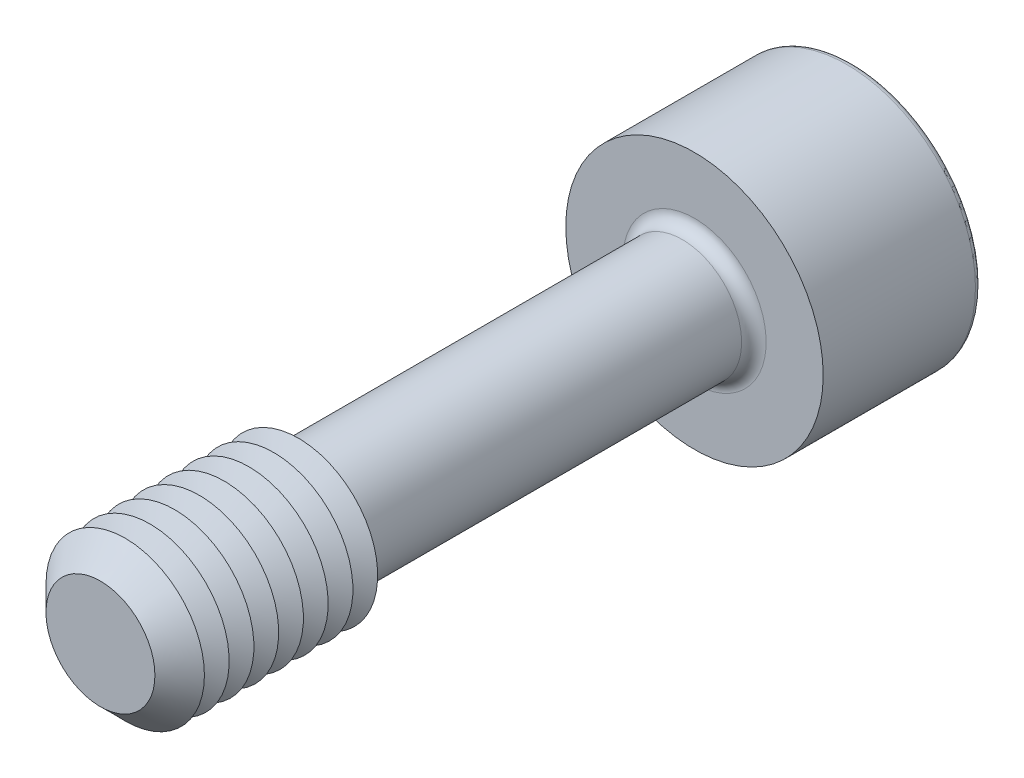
ISO-10303-21;
HEADER;
FILE_DESCRIPTION(('STEP AP214'),'2;1');
FILE_NAME('part.step','',(''),(''),'','','');
FILE_SCHEMA(('AUTOMOTIVE_DESIGN { 1 0 10303 214 1 1 1 1 }'));
ENDSEC;
DATA;
#1=APPLICATION_CONTEXT('core data for automotive mechanical design processes');
#2=APPLICATION_PROTOCOL_DEFINITION('international standard','automotive_design',2000,#1);
#3=PRODUCT_CONTEXT('',#1,'mechanical');
#4=PRODUCT('Part','Part','',(#3));
#5=PRODUCT_RELATED_PRODUCT_CATEGORY('part','',(#4));
#6=PRODUCT_DEFINITION_FORMATION('','',#4);
#7=PRODUCT_DEFINITION_CONTEXT('part definition',#1,'design');
#8=PRODUCT_DEFINITION('design','',#6,#7);
#9=PRODUCT_DEFINITION_SHAPE('','',#8);
#10=(LENGTH_UNIT() NAMED_UNIT(*) SI_UNIT(.MILLI.,.METRE.));
#11=(NAMED_UNIT(*) PLANE_ANGLE_UNIT() SI_UNIT($,.RADIAN.));
#12=(NAMED_UNIT(*) SI_UNIT($,.STERADIAN.) SOLID_ANGLE_UNIT());
#13=UNCERTAINTY_MEASURE_WITH_UNIT(LENGTH_MEASURE(1.E-05),#10,'distance_accuracy_value','');
#14=(GEOMETRIC_REPRESENTATION_CONTEXT(3) GLOBAL_UNCERTAINTY_ASSIGNED_CONTEXT((#13)) GLOBAL_UNIT_ASSIGNED_CONTEXT((#10,
#11,#12)) REPRESENTATION_CONTEXT('',''));
#15=CARTESIAN_POINT('',(0.,0.,0.));
#16=DIRECTION('',(0.,0.,1.));
#17=DIRECTION('',(1.,0.,0.));
#18=AXIS2_PLACEMENT_3D('',#15,#16,#17);
#19=CARTESIAN_POINT('',(-1.73205080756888,-3.,-17.));
#20=DIRECTION('',(0.,0.,1.));
#21=DIRECTION('',(1.,0.,0.));
#22=AXIS2_PLACEMENT_3D('',#19,#20,#21);
#23=PLANE('',#22);
#24=DIRECTION('',(1.,0.,0.));
#25=VECTOR('',#24,1.);
#26=CARTESIAN_POINT('',(-1.73205080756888,-3.,-17.));
#27=LINE('',#26,#25);
#28=CARTESIAN_POINT('',(0.,-3.,-17.));
#29=VERTEX_POINT('',#28);
#30=CARTESIAN_POINT('',(1.73205080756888,-3.,-17.));
#31=VERTEX_POINT('',#30);
#32=EDGE_CURVE('E403',#29,#31,#27,.T.);
#33=ORIENTED_EDGE('',*,*,#32,.F.);
#34=CARTESIAN_POINT('',(0.,0.,-17.));
#35=DIRECTION('',(0.,0.,1.));
#36=DIRECTION('',(0.,-1.,0.));
#37=AXIS2_PLACEMENT_3D('',#34,#35,#36);
#38=CIRCLE('',#37,3.);
#39=CARTESIAN_POINT('',(2.59807621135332,-1.5,-17.));
#40=VERTEX_POINT('',#39);
#41=EDGE_CURVE('E53',#29,#40,#38,.T.);
#42=ORIENTED_EDGE('',*,*,#41,.T.);
#43=DIRECTION('',(0.5,0.866025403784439,0.));
#44=VECTOR('',#43,1.);
#45=CARTESIAN_POINT('',(1.73205080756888,-3.,-17.));
#46=LINE('',#45,#44);
#47=EDGE_CURVE('E392',#31,#40,#46,.T.);
#48=ORIENTED_EDGE('',*,*,#47,.F.);
#49=EDGE_LOOP('',(#33,#42,#48));
#50=FACE_BOUND('',#49,.T.);
#51=ADVANCED_FACE('F41',(#50),#23,.F.);
#52=CARTESIAN_POINT('',(3.46410161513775,0.,-17.));
#53=VERTEX_POINT('',#52);
#54=EDGE_CURVE('E397',#40,#53,#46,.T.);
#55=ORIENTED_EDGE('',*,*,#54,.F.);
#56=CARTESIAN_POINT('',(2.59807621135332,1.5,-17.));
#57=VERTEX_POINT('',#56);
#58=EDGE_CURVE('E11',#40,#57,#38,.T.);
#59=ORIENTED_EDGE('',*,*,#58,.T.);
#60=DIRECTION('',(-0.5,0.866025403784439,0.));
#61=VECTOR('',#60,1.);
#62=CARTESIAN_POINT('',(3.46410161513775,0.,-17.));
#63=LINE('',#62,#61);
#64=EDGE_CURVE('E389',#53,#57,#63,.T.);
#65=ORIENTED_EDGE('',*,*,#64,.F.);
#66=EDGE_LOOP('',(#55,#59,#65));
#67=FACE_BOUND('',#66,.T.);
#68=ADVANCED_FACE('F133',(#67),#23,.F.);
#69=CARTESIAN_POINT('',(1.73205080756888,3.,-17.));
#70=VERTEX_POINT('',#69);
#71=EDGE_CURVE('E388',#57,#70,#63,.T.);
#72=ORIENTED_EDGE('',*,*,#71,.F.);
#73=CARTESIAN_POINT('',(0.,3.,-17.));
#74=VERTEX_POINT('',#73);
#75=EDGE_CURVE('E51',#57,#74,#38,.T.);
#76=ORIENTED_EDGE('',*,*,#75,.T.);
#77=DIRECTION('',(-1.,0.,0.));
#78=VECTOR('',#77,1.);
#79=CARTESIAN_POINT('',(1.73205080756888,3.,-17.));
#80=LINE('',#79,#78);
#81=EDGE_CURVE('E177',#70,#74,#80,.T.);
#82=ORIENTED_EDGE('',*,*,#81,.F.);
#83=EDGE_LOOP('',(#72,#76,#82));
#84=FACE_BOUND('',#83,.T.);
#85=ADVANCED_FACE('F139',(#84),#23,.F.);
#86=CARTESIAN_POINT('',(-1.73205080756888,3.,-17.));
#87=VERTEX_POINT('',#86);
#88=EDGE_CURVE('E394',#74,#87,#80,.T.);
#89=ORIENTED_EDGE('',*,*,#88,.F.);
#90=CARTESIAN_POINT('',(-2.59807621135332,1.5,-17.));
#91=VERTEX_POINT('',#90);
#92=EDGE_CURVE('E262',#74,#91,#38,.T.);
#93=ORIENTED_EDGE('',*,*,#92,.T.);
#94=DIRECTION('',(-0.5,-0.866025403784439,0.));
#95=VECTOR('',#94,1.);
#96=CARTESIAN_POINT('',(-1.73205080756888,3.,-17.));
#97=LINE('',#96,#95);
#98=EDGE_CURVE('E176',#87,#91,#97,.T.);
#99=ORIENTED_EDGE('',*,*,#98,.F.);
#100=EDGE_LOOP('',(#89,#93,#99));
#101=FACE_BOUND('',#100,.T.);
#102=ADVANCED_FACE('F157',(#101),#23,.F.);
#103=CARTESIAN_POINT('',(-3.46410161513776,0.,-17.));
#104=VERTEX_POINT('',#103);
#105=EDGE_CURVE('E170',#91,#104,#97,.T.);
#106=ORIENTED_EDGE('',*,*,#105,.F.);
#107=CARTESIAN_POINT('',(-2.59807621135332,-1.5,-17.));
#108=VERTEX_POINT('',#107);
#109=EDGE_CURVE('E172',#91,#108,#38,.T.);
#110=ORIENTED_EDGE('',*,*,#109,.T.);
#111=DIRECTION('',(0.5,-0.866025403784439,0.));
#112=VECTOR('',#111,1.);
#113=CARTESIAN_POINT('',(-3.46410161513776,0.,-17.));
#114=LINE('',#113,#112);
#115=EDGE_CURVE('E174',#104,#108,#114,.T.);
#116=ORIENTED_EDGE('',*,*,#115,.F.);
#117=EDGE_LOOP('',(#106,#110,#116));
#118=FACE_BOUND('',#117,.T.);
#119=ADVANCED_FACE('F146',(#118),#23,.F.);
#120=CARTESIAN_POINT('',(0.,0.,-23.));
#121=DIRECTION('',(0.,0.,-1.));
#122=DIRECTION('',(-1.,0.,0.));
#123=AXIS2_PLACEMENT_3D('',#120,#121,#122);
#124=PLANE('',#123);
#125=CARTESIAN_POINT('',(0.,0.,-23.));
#126=DIRECTION('',(0.,0.,-1.));
#127=DIRECTION('',(-1.,0.,0.));
#128=AXIS2_PLACEMENT_3D('',#125,#126,#127);
#129=CIRCLE('',#128,6.19);
#130=CARTESIAN_POINT('',(-6.19,0.,-23.));
#131=VERTEX_POINT('',#130);
#132=EDGE_CURVE('E248',#131,#131,#129,.T.);
#133=ORIENTED_EDGE('',*,*,#132,.T.);
#134=EDGE_LOOP('',(#133));
#135=FACE_BOUND('',#134,.T.);
#136=DIRECTION('',(-0.5,-0.866025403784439,0.));
#137=VECTOR('',#136,1.);
#138=CARTESIAN_POINT('',(-1.73205080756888,3.,-23.));
#139=LINE('',#138,#137);
#140=CARTESIAN_POINT('',(-1.73205080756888,3.,-23.));
#141=VERTEX_POINT('',#140);
#142=CARTESIAN_POINT('',(-3.46410161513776,0.,-23.));
#143=VERTEX_POINT('',#142);
#144=EDGE_CURVE('E210',#141,#143,#139,.T.);
#145=ORIENTED_EDGE('',*,*,#144,.T.);
#146=DIRECTION('',(0.5,-0.866025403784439,0.));
#147=VECTOR('',#146,1.);
#148=CARTESIAN_POINT('',(-3.46410161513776,0.,-23.));
#149=LINE('',#148,#147);
#150=CARTESIAN_POINT('',(-1.73205080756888,-3.,-23.));
#151=VERTEX_POINT('',#150);
#152=EDGE_CURVE('E67',#143,#151,#149,.T.);
#153=ORIENTED_EDGE('',*,*,#152,.T.);
#154=DIRECTION('',(1.,0.,0.));
#155=VECTOR('',#154,1.);
#156=CARTESIAN_POINT('',(-1.73205080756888,-3.,-23.));
#157=LINE('',#156,#155);
#158=CARTESIAN_POINT('',(1.73205080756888,-3.,-23.));
#159=VERTEX_POINT('',#158);
#160=EDGE_CURVE('E195',#151,#159,#157,.T.);
#161=ORIENTED_EDGE('',*,*,#160,.T.);
#162=DIRECTION('',(0.5,0.866025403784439,0.));
#163=VECTOR('',#162,1.);
#164=CARTESIAN_POINT('',(1.73205080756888,-3.,-23.));
#165=LINE('',#164,#163);
#166=CARTESIAN_POINT('',(3.46410161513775,0.,-23.));
#167=VERTEX_POINT('',#166);
#168=EDGE_CURVE('E198',#159,#167,#165,.T.);
#169=ORIENTED_EDGE('',*,*,#168,.T.);
#170=DIRECTION('',(-0.5,0.866025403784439,0.));
#171=VECTOR('',#170,1.);
#172=CARTESIAN_POINT('',(3.46410161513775,0.,-23.));
#173=LINE('',#172,#171);
#174=CARTESIAN_POINT('',(1.73205080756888,3.,-23.));
#175=VERTEX_POINT('',#174);
#176=EDGE_CURVE('E202',#167,#175,#173,.T.);
#177=ORIENTED_EDGE('',*,*,#176,.T.);
#178=DIRECTION('',(-1.,0.,0.));
#179=VECTOR('',#178,1.);
#180=CARTESIAN_POINT('',(1.73205080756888,3.,-23.));
#181=LINE('',#180,#179);
#182=EDGE_CURVE('E206',#175,#141,#181,.T.);
#183=ORIENTED_EDGE('',*,*,#182,.T.);
#184=EDGE_LOOP('',(#145,#153,#161,#169,#177,#183));
#185=FACE_BOUND('',#184,.T.);
#186=ADVANCED_FACE('F156',(#135,#185),#124,.T.);
#187=CARTESIAN_POINT('',(0.,0.,15.));
#188=DIRECTION('',(0.,0.,-1.));
#189=DIRECTION('',(-1.,0.,0.));
#190=AXIS2_PLACEMENT_3D('',#187,#188,#189);
#191=CYLINDRICAL_SURFACE('',#190,3.);
#192=CARTESIAN_POINT('',(0.,0.,-14.38));
#193=DIRECTION('',(0.,0.,-1.));
#194=DIRECTION('',(-1.,0.,0.));
#195=AXIS2_PLACEMENT_3D('',#192,#193,#194);
#196=CIRCLE('',#195,3.);
#197=CARTESIAN_POINT('',(-3.,0.,-14.38));
#198=VERTEX_POINT('',#197);
#199=EDGE_CURVE('E245',#198,#198,#196,.F.);
#200=ORIENTED_EDGE('',*,*,#199,.T.);
#201=EDGE_LOOP('',(#200));
#202=FACE_BOUND('',#201,.T.);
#203=CARTESIAN_POINT('',(0.,0.,4.42264973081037));
#204=DIRECTION('',(0.,0.,-1.));
#205=DIRECTION('',(0.,1.,0.));
#206=AXIS2_PLACEMENT_3D('',#203,#204,#205);
#207=CIRCLE('',#206,3.);
#208=CARTESIAN_POINT('',(0.,3.,4.42264973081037));
#209=VERTEX_POINT('',#208);
#210=EDGE_CURVE('E233',#209,#209,#207,.T.);
#211=ORIENTED_EDGE('',*,*,#210,.T.);
#212=EDGE_LOOP('',(#211));
#213=FACE_BOUND('',#212,.T.);
#214=ADVANCED_FACE('F163',(#202,#213),#191,.T.);
#215=CARTESIAN_POINT('',(0.,0.,4.42264973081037));
#216=DIRECTION('',(0.,0.,1.));
#217=DIRECTION('',(0.,-1.,0.));
#218=AXIS2_PLACEMENT_3D('',#215,#216,#217);
#219=CONICAL_SURFACE('',#218,3.,1.0471975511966);
#220=CARTESIAN_POINT('',(0.,0.,5.));
#221=DIRECTION('',(0.,0.,-1.));
#222=DIRECTION('',(-1.,0.,0.));
#223=AXIS2_PLACEMENT_3D('',#220,#221,#222);
#224=CIRCLE('',#223,4.);
#225=CARTESIAN_POINT('',(-4.,0.,5.));
#226=VERTEX_POINT('',#225);
#227=EDGE_CURVE('E266',#226,#226,#224,.T.);
#228=ORIENTED_EDGE('',*,*,#227,.T.);
#229=EDGE_LOOP('',(#228));
#230=FACE_BOUND('',#229,.T.);
#231=ORIENTED_EDGE('',*,*,#210,.F.);
#232=EDGE_LOOP('',(#231));
#233=FACE_BOUND('',#232,.T.);
#234=ADVANCED_FACE('F346',(#230,#233),#219,.T.);
#235=CARTESIAN_POINT('',(0.,0.,-15.));
#236=DIRECTION('',(0.,0.,-1.));
#237=DIRECTION('',(-1.,0.,0.));
#238=AXIS2_PLACEMENT_3D('',#235,#236,#237);
#239=PLANE('',#238);
#240=CARTESIAN_POINT('',(0.,0.,-15.));
#241=DIRECTION('',(0.,0.,-1.));
#242=DIRECTION('',(-1.,0.,0.));
#243=AXIS2_PLACEMENT_3D('',#240,#241,#242);
#244=CIRCLE('',#243,3.62);
#245=CARTESIAN_POINT('',(-3.62,0.,-15.));
#246=VERTEX_POINT('',#245);
#247=EDGE_CURVE('E241',#246,#246,#244,.T.);
#248=ORIENTED_EDGE('',*,*,#247,.T.);
#249=EDGE_LOOP('',(#248));
#250=FACE_BOUND('',#249,.T.);
#251=CARTESIAN_POINT('',(0.,0.,-15.));
#252=DIRECTION('',(0.,0.,-1.));
#253=DIRECTION('',(-1.,0.,0.));
#254=AXIS2_PLACEMENT_3D('',#251,#252,#253);
#255=CIRCLE('',#254,6.5);
#256=CARTESIAN_POINT('',(-6.5,0.,-15.));
#257=VERTEX_POINT('',#256);
#258=EDGE_CURVE('E229',#257,#257,#255,.T.);
#259=ORIENTED_EDGE('',*,*,#258,.F.);
#260=EDGE_LOOP('',(#259));
#261=FACE_BOUND('',#260,.T.);
#262=ADVANCED_FACE('F351',(#250,#261),#239,.F.);
#263=CARTESIAN_POINT('',(0.,0.,-23.));
#264=DIRECTION('',(0.,0.,1.));
#265=DIRECTION('',(1.,0.,0.));
#266=AXIS2_PLACEMENT_3D('',#263,#264,#265);
#267=CYLINDRICAL_SURFACE('',#266,6.5);
#268=CARTESIAN_POINT('',(0.,0.,-22.69));
#269=DIRECTION('',(0.,0.,-1.));
#270=DIRECTION('',(-1.,0.,0.));
#271=AXIS2_PLACEMENT_3D('',#268,#269,#270);
#272=CIRCLE('',#271,6.5);
#273=CARTESIAN_POINT('',(-6.5,0.,-22.69));
#274=VERTEX_POINT('',#273);
#275=EDGE_CURVE('E45',#274,#274,#272,.F.);
#276=ORIENTED_EDGE('',*,*,#275,.T.);
#277=EDGE_LOOP('',(#276));
#278=FACE_BOUND('',#277,.T.);
#279=ORIENTED_EDGE('',*,*,#258,.T.);
#280=EDGE_LOOP('',(#279));
#281=FACE_BOUND('',#280,.T.);
#282=ADVANCED_FACE('F352',(#278,#281),#267,.T.);
#283=CARTESIAN_POINT('',(-3.46410161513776,0.,-17.));
#284=DIRECTION('',(0.866025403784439,0.5,0.));
#285=DIRECTION('',(-0.5,0.866025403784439,0.));
#286=AXIS2_PLACEMENT_3D('',#283,#284,#285);
#287=PLANE('',#286);
#288=ORIENTED_EDGE('',*,*,#152,.F.);
#289=DIRECTION('',(0.,0.,-1.));
#290=VECTOR('',#289,1.);
#291=CARTESIAN_POINT('',(-3.46410161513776,0.,-17.));
#292=LINE('',#291,#290);
#293=EDGE_CURVE('E186',#104,#143,#292,.T.);
#294=ORIENTED_EDGE('',*,*,#293,.F.);
#295=ORIENTED_EDGE('',*,*,#115,.T.);
#296=CARTESIAN_POINT('',(-1.73205080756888,-3.,-17.));
#297=VERTEX_POINT('',#296);
#298=EDGE_CURVE('E213',#108,#297,#114,.T.);
#299=ORIENTED_EDGE('',*,*,#298,.T.);
#300=DIRECTION('',(0.,0.,-1.));
#301=VECTOR('',#300,1.);
#302=CARTESIAN_POINT('',(-1.73205080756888,-3.,-17.));
#303=LINE('',#302,#301);
#304=EDGE_CURVE('E226',#297,#151,#303,.T.);
#305=ORIENTED_EDGE('',*,*,#304,.T.);
#306=EDGE_LOOP('',(#288,#294,#295,#299,#305));
#307=FACE_BOUND('',#306,.T.);
#308=ADVANCED_FACE('F355',(#307),#287,.T.);
#309=CARTESIAN_POINT('',(-1.73205080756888,-3.,-17.));
#310=DIRECTION('',(0.,1.,0.));
#311=DIRECTION('',(0.,0.,1.));
#312=AXIS2_PLACEMENT_3D('',#309,#310,#311);
#313=PLANE('',#312);
#314=ORIENTED_EDGE('',*,*,#160,.F.);
#315=ORIENTED_EDGE('',*,*,#304,.F.);
#316=EDGE_CURVE('E400',#297,#29,#27,.T.);
#317=ORIENTED_EDGE('',*,*,#316,.T.);
#318=ORIENTED_EDGE('',*,*,#32,.T.);
#319=DIRECTION('',(0.,0.,-1.));
#320=VECTOR('',#319,1.);
#321=CARTESIAN_POINT('',(1.73205080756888,-3.,-17.));
#322=LINE('',#321,#320);
#323=EDGE_CURVE('E223',#31,#159,#322,.T.);
#324=ORIENTED_EDGE('',*,*,#323,.T.);
#325=EDGE_LOOP('',(#314,#315,#317,#318,#324));
#326=FACE_BOUND('',#325,.T.);
#327=ADVANCED_FACE('F361',(#326),#313,.T.);
#328=CARTESIAN_POINT('',(1.73205080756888,-3.,-17.));
#329=DIRECTION('',(-0.866025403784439,0.5,0.));
#330=DIRECTION('',(-0.5,-0.866025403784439,0.));
#331=AXIS2_PLACEMENT_3D('',#328,#329,#330);
#332=PLANE('',#331);
#333=ORIENTED_EDGE('',*,*,#168,.F.);
#334=ORIENTED_EDGE('',*,*,#323,.F.);
#335=ORIENTED_EDGE('',*,*,#47,.T.);
#336=ORIENTED_EDGE('',*,*,#54,.T.);
#337=DIRECTION('',(0.,0.,-1.));
#338=VECTOR('',#337,1.);
#339=CARTESIAN_POINT('',(3.46410161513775,0.,-17.));
#340=LINE('',#339,#338);
#341=EDGE_CURVE('E220',#53,#167,#340,.T.);
#342=ORIENTED_EDGE('',*,*,#341,.T.);
#343=EDGE_LOOP('',(#333,#334,#335,#336,#342));
#344=FACE_BOUND('',#343,.T.);
#345=ADVANCED_FACE('F364',(#344),#332,.T.);
#346=CARTESIAN_POINT('',(3.46410161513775,0.,-17.));
#347=DIRECTION('',(-0.866025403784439,-0.5,0.));
#348=DIRECTION('',(0.5,-0.866025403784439,0.));
#349=AXIS2_PLACEMENT_3D('',#346,#347,#348);
#350=PLANE('',#349);
#351=ORIENTED_EDGE('',*,*,#176,.F.);
#352=ORIENTED_EDGE('',*,*,#341,.F.);
#353=ORIENTED_EDGE('',*,*,#64,.T.);
#354=ORIENTED_EDGE('',*,*,#71,.T.);
#355=DIRECTION('',(0.,0.,-1.));
#356=VECTOR('',#355,1.);
#357=CARTESIAN_POINT('',(1.73205080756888,3.,-17.));
#358=LINE('',#357,#356);
#359=EDGE_CURVE('E217',#70,#175,#358,.T.);
#360=ORIENTED_EDGE('',*,*,#359,.T.);
#361=EDGE_LOOP('',(#351,#352,#353,#354,#360));
#362=FACE_BOUND('',#361,.T.);
#363=ADVANCED_FACE('F368',(#362),#350,.T.);
#364=CARTESIAN_POINT('',(1.73205080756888,3.,-17.));
#365=DIRECTION('',(0.,-1.,0.));
#366=DIRECTION('',(1.,0.,0.));
#367=AXIS2_PLACEMENT_3D('',#364,#365,#366);
#368=PLANE('',#367);
#369=ORIENTED_EDGE('',*,*,#182,.F.);
#370=ORIENTED_EDGE('',*,*,#359,.F.);
#371=ORIENTED_EDGE('',*,*,#81,.T.);
#372=ORIENTED_EDGE('',*,*,#88,.T.);
#373=DIRECTION('',(0.,0.,-1.));
#374=VECTOR('',#373,1.);
#375=CARTESIAN_POINT('',(-1.73205080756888,3.,-17.));
#376=LINE('',#375,#374);
#377=EDGE_CURVE('E182',#87,#141,#376,.T.);
#378=ORIENTED_EDGE('',*,*,#377,.T.);
#379=EDGE_LOOP('',(#369,#370,#371,#372,#378));
#380=FACE_BOUND('',#379,.T.);
#381=ADVANCED_FACE('F152',(#380),#368,.T.);
#382=CARTESIAN_POINT('',(-1.73205080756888,3.,-17.));
#383=DIRECTION('',(0.866025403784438,-0.5,0.));
#384=DIRECTION('',(0.5,0.866025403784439,0.));
#385=AXIS2_PLACEMENT_3D('',#382,#383,#384);
#386=PLANE('',#385);
#387=ORIENTED_EDGE('',*,*,#144,.F.);
#388=ORIENTED_EDGE('',*,*,#377,.F.);
#389=ORIENTED_EDGE('',*,*,#98,.T.);
#390=ORIENTED_EDGE('',*,*,#105,.T.);
#391=ORIENTED_EDGE('',*,*,#293,.T.);
#392=EDGE_LOOP('',(#387,#388,#389,#390,#391));
#393=FACE_BOUND('',#392,.T.);
#394=ADVANCED_FACE('F144',(#393),#386,.T.);
#395=ORIENTED_EDGE('',*,*,#298,.F.);
#396=EDGE_CURVE('E255',#108,#29,#38,.T.);
#397=ORIENTED_EDGE('',*,*,#396,.T.);
#398=ORIENTED_EDGE('',*,*,#316,.F.);
#399=EDGE_LOOP('',(#395,#397,#398));
#400=FACE_BOUND('',#399,.T.);
#401=ADVANCED_FACE('F135',(#400),#23,.F.);
#402=CARTESIAN_POINT('',(0.,0.,-14.38));
#403=DIRECTION('',(0.,0.,-1.));
#404=DIRECTION('',(-1.,0.,0.));
#405=AXIS2_PLACEMENT_3D('',#402,#403,#404);
#406=TOROIDAL_SURFACE('',#405,3.62,0.62);
#407=ORIENTED_EDGE('',*,*,#199,.F.);
#408=EDGE_LOOP('',(#407));
#409=FACE_BOUND('',#408,.T.);
#410=ORIENTED_EDGE('',*,*,#247,.F.);
#411=EDGE_LOOP('',(#410));
#412=FACE_BOUND('',#411,.T.);
#413=ADVANCED_FACE('F129',(#409,#412),#406,.F.);
#414=CARTESIAN_POINT('',(0.,0.,-22.69));
#415=DIRECTION('',(0.,0.,-1.));
#416=DIRECTION('',(-1.,0.,0.));
#417=AXIS2_PLACEMENT_3D('',#414,#415,#416);
#418=TOROIDAL_SURFACE('',#417,6.19,0.31);
#419=ORIENTED_EDGE('',*,*,#275,.F.);
#420=EDGE_LOOP('',(#419));
#421=FACE_BOUND('',#420,.T.);
#422=ORIENTED_EDGE('',*,*,#132,.F.);
#423=EDGE_LOOP('',(#422));
#424=FACE_BOUND('',#423,.T.);
#425=ADVANCED_FACE('F43',(#421,#424),#418,.T.);
#426=CARTESIAN_POINT('',(0.,0.,-15.2679491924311));
#427=DIRECTION('',(0.,0.,-1.));
#428=DIRECTION('',(0.,1.,0.));
#429=AXIS2_PLACEMENT_3D('',#426,#427,#428);
#430=CONICAL_SURFACE('',#429,0.,1.0471975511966);
#431=ORIENTED_EDGE('',*,*,#41,.F.);
#432=ORIENTED_EDGE('',*,*,#396,.F.);
#433=ORIENTED_EDGE('',*,*,#109,.F.);
#434=ORIENTED_EDGE('',*,*,#92,.F.);
#435=ORIENTED_EDGE('',*,*,#75,.F.);
#436=ORIENTED_EDGE('',*,*,#58,.F.);
#437=EDGE_LOOP('',(#431,#432,#433,#434,#435,#436));
#438=FACE_BOUND('',#437,.T.);
#439=CARTESIAN_POINT('',(0.,0.,-15.2679491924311));
#440=VERTEX_POINT('',#439);
#441=VERTEX_LOOP('',#440);
#442=FACE_BOUND('',#441,.T.);
#443=ADVANCED_FACE('F118',(#438,#442),#430,.F.);
#444=CARTESIAN_POINT('',(0.,0.,5.625));
#445=DIRECTION('',(0.,0.,-1.));
#446=DIRECTION('',(-1.,0.,0.));
#447=AXIS2_PLACEMENT_3D('',#444,#445,#446);
#448=CONICAL_SURFACE('',#447,2.91746824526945,1.0471975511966);
#449=ORIENTED_EDGE('',*,*,#227,.F.);
#450=EDGE_LOOP('',(#449));
#451=FACE_BOUND('',#450,.T.);
#452=CARTESIAN_POINT('',(0.,0.,5.625));
#453=DIRECTION('',(0.,0.,-1.));
#454=DIRECTION('',(-1.,0.,0.));
#455=AXIS2_PLACEMENT_3D('',#452,#453,#454);
#456=CIRCLE('',#455,2.91746824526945);
#457=CARTESIAN_POINT('',(-2.91746824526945,0.,5.625));
#458=VERTEX_POINT('',#457);
#459=EDGE_CURVE('E271',#458,#458,#456,.T.);
#460=ORIENTED_EDGE('',*,*,#459,.T.);
#461=EDGE_LOOP('',(#460));
#462=FACE_BOUND('',#461,.T.);
#463=ADVANCED_FACE('F120',(#451,#462),#448,.T.);
#464=CARTESIAN_POINT('',(0.,0.,6.25));
#465=DIRECTION('',(0.,0.,1.));
#466=DIRECTION('',(1.,0.,0.));
#467=AXIS2_PLACEMENT_3D('',#464,#465,#466);
#468=CONICAL_SURFACE('',#467,4.,1.0471975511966);
#469=ORIENTED_EDGE('',*,*,#459,.F.);
#470=EDGE_LOOP('',(#469));
#471=FACE_BOUND('',#470,.T.);
#472=CARTESIAN_POINT('',(0.,0.,6.25));
#473=DIRECTION('',(0.,0.,-1.));
#474=DIRECTION('',(-1.,0.,0.));
#475=AXIS2_PLACEMENT_3D('',#472,#473,#474);
#476=CIRCLE('',#475,4.);
#477=CARTESIAN_POINT('',(-4.,0.,6.25));
#478=VERTEX_POINT('',#477);
#479=EDGE_CURVE('E276',#478,#478,#476,.T.);
#480=ORIENTED_EDGE('',*,*,#479,.T.);
#481=EDGE_LOOP('',(#480));
#482=FACE_BOUND('',#481,.T.);
#483=ADVANCED_FACE('F126',(#471,#482),#468,.T.);
#484=CARTESIAN_POINT('',(0.,0.,6.875));
#485=DIRECTION('',(0.,0.,-1.));
#486=DIRECTION('',(-1.,0.,0.));
#487=AXIS2_PLACEMENT_3D('',#484,#485,#486);
#488=CONICAL_SURFACE('',#487,2.91746824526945,1.0471975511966);
#489=ORIENTED_EDGE('',*,*,#479,.F.);
#490=EDGE_LOOP('',(#489));
#491=FACE_BOUND('',#490,.T.);
#492=CARTESIAN_POINT('',(0.,0.,6.875));
#493=DIRECTION('',(0.,0.,-1.));
#494=DIRECTION('',(-1.,0.,0.));
#495=AXIS2_PLACEMENT_3D('',#492,#493,#494);
#496=CIRCLE('',#495,2.91746824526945);
#497=CARTESIAN_POINT('',(-2.91746824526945,0.,6.875));
#498=VERTEX_POINT('',#497);
#499=EDGE_CURVE('E282',#498,#498,#496,.T.);
#500=ORIENTED_EDGE('',*,*,#499,.T.);
#501=EDGE_LOOP('',(#500));
#502=FACE_BOUND('',#501,.T.);
#503=ADVANCED_FACE('F508',(#491,#502),#488,.T.);
#504=CARTESIAN_POINT('',(0.,0.,7.5));
#505=DIRECTION('',(0.,0.,1.));
#506=DIRECTION('',(1.,0.,0.));
#507=AXIS2_PLACEMENT_3D('',#504,#505,#506);
#508=CONICAL_SURFACE('',#507,4.,1.0471975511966);
#509=ORIENTED_EDGE('',*,*,#499,.F.);
#510=EDGE_LOOP('',(#509));
#511=FACE_BOUND('',#510,.T.);
#512=CARTESIAN_POINT('',(0.,0.,7.5));
#513=DIRECTION('',(0.,0.,-1.));
#514=DIRECTION('',(-1.,0.,0.));
#515=AXIS2_PLACEMENT_3D('',#512,#513,#514);
#516=CIRCLE('',#515,4.);
#517=CARTESIAN_POINT('',(-4.,0.,7.5));
#518=VERTEX_POINT('',#517);
#519=EDGE_CURVE('E286',#518,#518,#516,.T.);
#520=ORIENTED_EDGE('',*,*,#519,.T.);
#521=EDGE_LOOP('',(#520));
#522=FACE_BOUND('',#521,.T.);
#523=ADVANCED_FACE('F517',(#511,#522),#508,.T.);
#524=CARTESIAN_POINT('',(0.,0.,8.125));
#525=DIRECTION('',(0.,0.,-1.));
#526=DIRECTION('',(-1.,0.,0.));
#527=AXIS2_PLACEMENT_3D('',#524,#525,#526);
#528=CONICAL_SURFACE('',#527,2.91746824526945,1.0471975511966);
#529=ORIENTED_EDGE('',*,*,#519,.F.);
#530=EDGE_LOOP('',(#529));
#531=FACE_BOUND('',#530,.T.);
#532=CARTESIAN_POINT('',(0.,0.,8.125));
#533=DIRECTION('',(0.,0.,-1.));
#534=DIRECTION('',(-1.,0.,0.));
#535=AXIS2_PLACEMENT_3D('',#532,#533,#534);
#536=CIRCLE('',#535,2.91746824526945);
#537=CARTESIAN_POINT('',(-2.91746824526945,0.,8.125));
#538=VERTEX_POINT('',#537);
#539=EDGE_CURVE('E289',#538,#538,#536,.T.);
#540=ORIENTED_EDGE('',*,*,#539,.T.);
#541=EDGE_LOOP('',(#540));
#542=FACE_BOUND('',#541,.T.);
#543=ADVANCED_FACE('F526',(#531,#542),#528,.T.);
#544=CARTESIAN_POINT('',(0.,0.,8.75));
#545=DIRECTION('',(0.,0.,1.));
#546=DIRECTION('',(1.,0.,0.));
#547=AXIS2_PLACEMENT_3D('',#544,#545,#546);
#548=CONICAL_SURFACE('',#547,4.,1.0471975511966);
#549=ORIENTED_EDGE('',*,*,#539,.F.);
#550=EDGE_LOOP('',(#549));
#551=FACE_BOUND('',#550,.T.);
#552=CARTESIAN_POINT('',(0.,0.,8.75));
#553=DIRECTION('',(0.,0.,-1.));
#554=DIRECTION('',(-1.,0.,0.));
#555=AXIS2_PLACEMENT_3D('',#552,#553,#554);
#556=CIRCLE('',#555,4.);
#557=CARTESIAN_POINT('',(-4.,0.,8.75));
#558=VERTEX_POINT('',#557);
#559=EDGE_CURVE('E293',#558,#558,#556,.T.);
#560=ORIENTED_EDGE('',*,*,#559,.T.);
#561=EDGE_LOOP('',(#560));
#562=FACE_BOUND('',#561,.T.);
#563=ADVANCED_FACE('F535',(#551,#562),#548,.T.);
#564=CARTESIAN_POINT('',(0.,0.,9.375));
#565=DIRECTION('',(0.,0.,-1.));
#566=DIRECTION('',(-1.,0.,0.));
#567=AXIS2_PLACEMENT_3D('',#564,#565,#566);
#568=CONICAL_SURFACE('',#567,2.91746824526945,1.0471975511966);
#569=ORIENTED_EDGE('',*,*,#559,.F.);
#570=EDGE_LOOP('',(#569));
#571=FACE_BOUND('',#570,.T.);
#572=CARTESIAN_POINT('',(0.,0.,9.375));
#573=DIRECTION('',(0.,0.,-1.));
#574=DIRECTION('',(-1.,0.,0.));
#575=AXIS2_PLACEMENT_3D('',#572,#573,#574);
#576=CIRCLE('',#575,2.91746824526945);
#577=CARTESIAN_POINT('',(-2.91746824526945,0.,9.375));
#578=VERTEX_POINT('',#577);
#579=EDGE_CURVE('E297',#578,#578,#576,.T.);
#580=ORIENTED_EDGE('',*,*,#579,.T.);
#581=EDGE_LOOP('',(#580));
#582=FACE_BOUND('',#581,.T.);
#583=ADVANCED_FACE('F544',(#571,#582),#568,.T.);
#584=CARTESIAN_POINT('',(0.,0.,10.));
#585=DIRECTION('',(0.,0.,1.));
#586=DIRECTION('',(1.,0.,0.));
#587=AXIS2_PLACEMENT_3D('',#584,#585,#586);
#588=CONICAL_SURFACE('',#587,4.,1.0471975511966);
#589=ORIENTED_EDGE('',*,*,#579,.F.);
#590=EDGE_LOOP('',(#589));
#591=FACE_BOUND('',#590,.T.);
#592=CARTESIAN_POINT('',(0.,0.,10.));
#593=DIRECTION('',(0.,0.,-1.));
#594=DIRECTION('',(-1.,0.,0.));
#595=AXIS2_PLACEMENT_3D('',#592,#593,#594);
#596=CIRCLE('',#595,4.);
#597=CARTESIAN_POINT('',(-4.,0.,10.));
#598=VERTEX_POINT('',#597);
#599=EDGE_CURVE('E301',#598,#598,#596,.T.);
#600=ORIENTED_EDGE('',*,*,#599,.T.);
#601=EDGE_LOOP('',(#600));
#602=FACE_BOUND('',#601,.T.);
#603=ADVANCED_FACE('F553',(#591,#602),#588,.T.);
#604=CARTESIAN_POINT('',(0.,0.,10.625));
#605=DIRECTION('',(0.,0.,-1.));
#606=DIRECTION('',(-1.,0.,0.));
#607=AXIS2_PLACEMENT_3D('',#604,#605,#606);
#608=CONICAL_SURFACE('',#607,2.91746824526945,1.0471975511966);
#609=ORIENTED_EDGE('',*,*,#599,.F.);
#610=EDGE_LOOP('',(#609));
#611=FACE_BOUND('',#610,.T.);
#612=CARTESIAN_POINT('',(0.,0.,10.625));
#613=DIRECTION('',(0.,0.,-1.));
#614=DIRECTION('',(-1.,0.,0.));
#615=AXIS2_PLACEMENT_3D('',#612,#613,#614);
#616=CIRCLE('',#615,2.91746824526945);
#617=CARTESIAN_POINT('',(-2.91746824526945,0.,10.625));
#618=VERTEX_POINT('',#617);
#619=EDGE_CURVE('E305',#618,#618,#616,.T.);
#620=ORIENTED_EDGE('',*,*,#619,.T.);
#621=EDGE_LOOP('',(#620));
#622=FACE_BOUND('',#621,.T.);
#623=ADVANCED_FACE('F562',(#611,#622),#608,.T.);
#624=CARTESIAN_POINT('',(0.,0.,11.25));
#625=DIRECTION('',(0.,0.,1.));
#626=DIRECTION('',(1.,0.,0.));
#627=AXIS2_PLACEMENT_3D('',#624,#625,#626);
#628=CONICAL_SURFACE('',#627,4.,1.0471975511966);
#629=ORIENTED_EDGE('',*,*,#619,.F.);
#630=EDGE_LOOP('',(#629));
#631=FACE_BOUND('',#630,.T.);
#632=CARTESIAN_POINT('',(0.,0.,11.25));
#633=DIRECTION('',(0.,0.,-1.));
#634=DIRECTION('',(-1.,0.,0.));
#635=AXIS2_PLACEMENT_3D('',#632,#633,#634);
#636=CIRCLE('',#635,4.);
#637=CARTESIAN_POINT('',(-4.,0.,11.25));
#638=VERTEX_POINT('',#637);
#639=EDGE_CURVE('E309',#638,#638,#636,.T.);
#640=ORIENTED_EDGE('',*,*,#639,.T.);
#641=EDGE_LOOP('',(#640));
#642=FACE_BOUND('',#641,.T.);
#643=ADVANCED_FACE('F571',(#631,#642),#628,.T.);
#644=CARTESIAN_POINT('',(0.,0.,11.875));
#645=DIRECTION('',(0.,0.,-1.));
#646=DIRECTION('',(-1.,0.,0.));
#647=AXIS2_PLACEMENT_3D('',#644,#645,#646);
#648=CONICAL_SURFACE('',#647,2.91746824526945,1.0471975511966);
#649=ORIENTED_EDGE('',*,*,#639,.F.);
#650=EDGE_LOOP('',(#649));
#651=FACE_BOUND('',#650,.T.);
#652=CARTESIAN_POINT('',(0.,0.,11.875));
#653=DIRECTION('',(0.,0.,-1.));
#654=DIRECTION('',(-1.,0.,0.));
#655=AXIS2_PLACEMENT_3D('',#652,#653,#654);
#656=CIRCLE('',#655,2.91746824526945);
#657=CARTESIAN_POINT('',(-2.91746824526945,0.,11.875));
#658=VERTEX_POINT('',#657);
#659=EDGE_CURVE('E313',#658,#658,#656,.T.);
#660=ORIENTED_EDGE('',*,*,#659,.T.);
#661=EDGE_LOOP('',(#660));
#662=FACE_BOUND('',#661,.T.);
#663=ADVANCED_FACE('F580',(#651,#662),#648,.T.);
#664=CARTESIAN_POINT('',(0.,0.,12.5));
#665=DIRECTION('',(0.,0.,1.));
#666=DIRECTION('',(1.,0.,0.));
#667=AXIS2_PLACEMENT_3D('',#664,#665,#666);
#668=CONICAL_SURFACE('',#667,4.,1.0471975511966);
#669=ORIENTED_EDGE('',*,*,#659,.F.);
#670=EDGE_LOOP('',(#669));
#671=FACE_BOUND('',#670,.T.);
#672=CARTESIAN_POINT('',(0.,0.,12.5));
#673=DIRECTION('',(0.,0.,-1.));
#674=DIRECTION('',(-1.,0.,0.));
#675=AXIS2_PLACEMENT_3D('',#672,#673,#674);
#676=CIRCLE('',#675,4.);
#677=CARTESIAN_POINT('',(-4.,0.,12.5));
#678=VERTEX_POINT('',#677);
#679=EDGE_CURVE('E317',#678,#678,#676,.T.);
#680=ORIENTED_EDGE('',*,*,#679,.T.);
#681=EDGE_LOOP('',(#680));
#682=FACE_BOUND('',#681,.T.);
#683=ADVANCED_FACE('F589',(#671,#682),#668,.T.);
#684=CARTESIAN_POINT('',(0.,0.,13.125));
#685=DIRECTION('',(0.,0.,-1.));
#686=DIRECTION('',(-1.,0.,0.));
#687=AXIS2_PLACEMENT_3D('',#684,#685,#686);
#688=CONICAL_SURFACE('',#687,2.91746824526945,1.0471975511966);
#689=ORIENTED_EDGE('',*,*,#679,.F.);
#690=EDGE_LOOP('',(#689));
#691=FACE_BOUND('',#690,.T.);
#692=CARTESIAN_POINT('',(0.,0.,13.125));
#693=DIRECTION('',(0.,0.,-1.));
#694=DIRECTION('',(-1.,0.,0.));
#695=AXIS2_PLACEMENT_3D('',#692,#693,#694);
#696=CIRCLE('',#695,2.91746824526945);
#697=CARTESIAN_POINT('',(-2.91746824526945,0.,13.125));
#698=VERTEX_POINT('',#697);
#699=EDGE_CURVE('E321',#698,#698,#696,.T.);
#700=ORIENTED_EDGE('',*,*,#699,.T.);
#701=EDGE_LOOP('',(#700));
#702=FACE_BOUND('',#701,.T.);
#703=ADVANCED_FACE('F598',(#691,#702),#688,.T.);
#704=CARTESIAN_POINT('',(0.,0.,13.75));
#705=DIRECTION('',(0.,0.,1.));
#706=DIRECTION('',(1.,0.,0.));
#707=AXIS2_PLACEMENT_3D('',#704,#705,#706);
#708=CONICAL_SURFACE('',#707,4.,1.0471975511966);
#709=ORIENTED_EDGE('',*,*,#699,.F.);
#710=EDGE_LOOP('',(#709));
#711=FACE_BOUND('',#710,.T.);
#712=CARTESIAN_POINT('',(0.,0.,13.75));
#713=DIRECTION('',(0.,0.,-1.));
#714=DIRECTION('',(-1.,0.,0.));
#715=AXIS2_PLACEMENT_3D('',#712,#713,#714);
#716=CIRCLE('',#715,4.);
#717=CARTESIAN_POINT('',(-4.,0.,13.75));
#718=VERTEX_POINT('',#717);
#719=EDGE_CURVE('E325',#718,#718,#716,.T.);
#720=ORIENTED_EDGE('',*,*,#719,.T.);
#721=EDGE_LOOP('',(#720));
#722=FACE_BOUND('',#721,.T.);
#723=ADVANCED_FACE('F331',(#711,#722),#708,.T.);
#724=CARTESIAN_POINT('',(0.,0.,15.));
#725=DIRECTION('',(0.,0.,1.));
#726=DIRECTION('',(1.,0.,0.));
#727=AXIS2_PLACEMENT_3D('',#724,#725,#726);
#728=PLANE('',#727);
#729=CARTESIAN_POINT('',(0.,0.,15.));
#730=DIRECTION('',(0.,0.,1.));
#731=DIRECTION('',(1.,0.,0.));
#732=AXIS2_PLACEMENT_3D('',#729,#730,#731);
#733=CIRCLE('',#732,2.75);
#734=CARTESIAN_POINT('',(2.75,0.,15.));
#735=VERTEX_POINT('',#734);
#736=EDGE_CURVE('E237',#735,#735,#733,.T.);
#737=ORIENTED_EDGE('',*,*,#736,.T.);
#738=EDGE_LOOP('',(#737));
#739=FACE_BOUND('',#738,.T.);
#740=ADVANCED_FACE('F335',(#739),#728,.T.);
#741=CARTESIAN_POINT('',(0.,0.,13.75));
#742=DIRECTION('',(0.,0.,-1.));
#743=DIRECTION('',(0.,1.,0.));
#744=AXIS2_PLACEMENT_3D('',#741,#742,#743);
#745=CONICAL_SURFACE('',#744,4.,0.785398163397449);
#746=ORIENTED_EDGE('',*,*,#736,.F.);
#747=EDGE_LOOP('',(#746));
#748=FACE_BOUND('',#747,.T.);
#749=ORIENTED_EDGE('',*,*,#719,.F.);
#750=EDGE_LOOP('',(#749));
#751=FACE_BOUND('',#750,.T.);
#752=ADVANCED_FACE('F333',(#748,#751),#745,.T.);
#753=CLOSED_SHELL('',(#51,#68,#85,#102,#119,#186,#214,#234,#262,#282,#308,#327,#345,#363,#381,
#394,#401,#413,#425,#443,#463,#483,#503,#523,#543,#563,#583,#603,#623,#643,#663,#683,#703,#723,
#740,#752));
#754=MANIFOLD_SOLID_BREP('B2',#753);
#755=ADVANCED_BREP_SHAPE_REPRESENTATION('',(#18,#754),#14);
#756=SHAPE_DEFINITION_REPRESENTATION(#9,#755);
ENDSEC;
END-ISO-10303-21;
